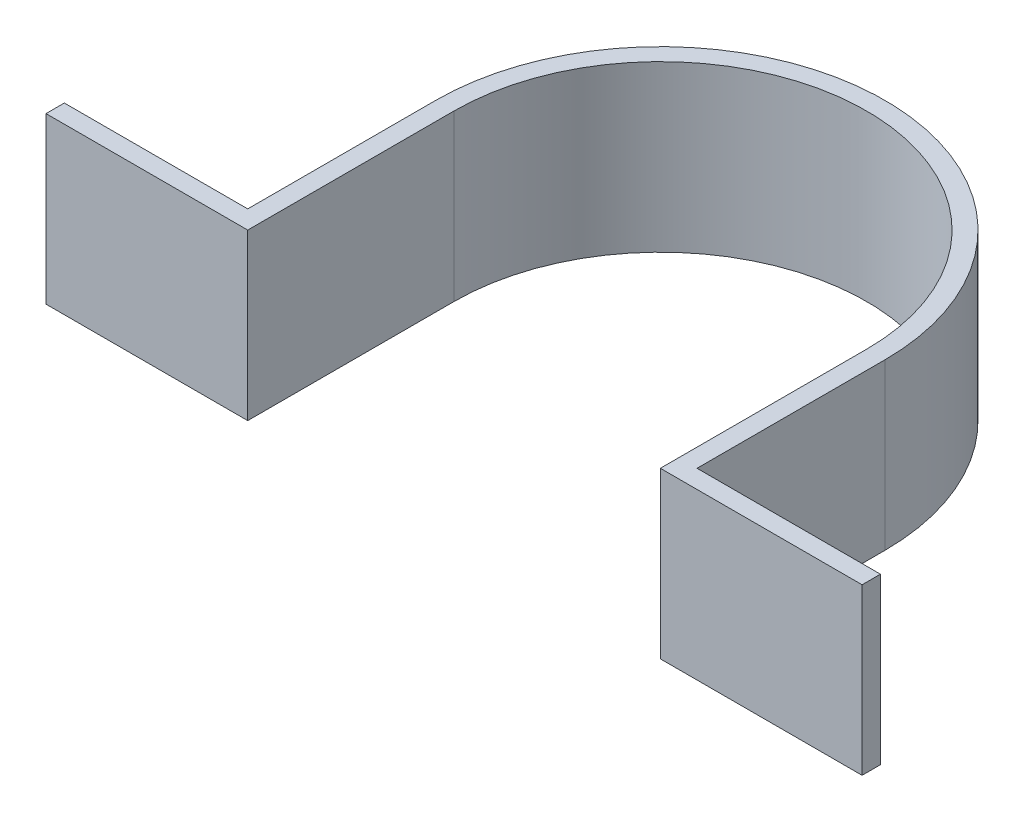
ISO-10303-21;
HEADER;
FILE_DESCRIPTION(('STEP AP214'),'2;1');
FILE_NAME('part.step','',(''),(''),'','','');
FILE_SCHEMA(('AUTOMOTIVE_DESIGN { 1 0 10303 214 1 1 1 1 }'));
ENDSEC;
DATA;
#1=APPLICATION_CONTEXT('core data for automotive mechanical design processes');
#2=APPLICATION_PROTOCOL_DEFINITION('international standard','automotive_design',2000,#1);
#3=PRODUCT_CONTEXT('',#1,'mechanical');
#4=PRODUCT('Part','Part','',(#3));
#5=PRODUCT_RELATED_PRODUCT_CATEGORY('part','',(#4));
#6=PRODUCT_DEFINITION_FORMATION('','',#4);
#7=PRODUCT_DEFINITION_CONTEXT('part definition',#1,'design');
#8=PRODUCT_DEFINITION('design','',#6,#7);
#9=PRODUCT_DEFINITION_SHAPE('','',#8);
#10=(LENGTH_UNIT() NAMED_UNIT(*) SI_UNIT(.MILLI.,.METRE.));
#11=(NAMED_UNIT(*) PLANE_ANGLE_UNIT() SI_UNIT($,.RADIAN.));
#12=(NAMED_UNIT(*) SI_UNIT($,.STERADIAN.) SOLID_ANGLE_UNIT());
#13=UNCERTAINTY_MEASURE_WITH_UNIT(LENGTH_MEASURE(1.E-05),#10,'distance_accuracy_value','');
#14=(GEOMETRIC_REPRESENTATION_CONTEXT(3) GLOBAL_UNCERTAINTY_ASSIGNED_CONTEXT((#13)) GLOBAL_UNIT_ASSIGNED_CONTEXT((#10,
#11,#12)) REPRESENTATION_CONTEXT('',''));
#15=CARTESIAN_POINT('',(0.,0.,0.));
#16=DIRECTION('',(0.,0.,1.));
#17=DIRECTION('',(1.,0.,0.));
#18=AXIS2_PLACEMENT_3D('',#15,#16,#17);
#19=CARTESIAN_POINT('',(0.,18.,0.));
#20=DIRECTION('',(0.,-1.,0.));
#21=DIRECTION('',(0.,0.,-1.));
#22=AXIS2_PLACEMENT_3D('',#19,#20,#21);
#23=CYLINDRICAL_SURFACE('',#22,22.5);
#24=CARTESIAN_POINT('',(0.,0.,0.));
#25=DIRECTION('',(0.,-1.,0.));
#26=DIRECTION('',(0.,0.,1.));
#27=AXIS2_PLACEMENT_3D('',#24,#25,#26);
#28=CIRCLE('',#27,22.5);
#29=CARTESIAN_POINT('',(-22.5,0.,0.));
#30=VERTEX_POINT('',#29);
#31=CARTESIAN_POINT('',(22.5,0.,0.));
#32=VERTEX_POINT('',#31);
#33=EDGE_CURVE('E168',#30,#32,#28,.T.);
#34=ORIENTED_EDGE('',*,*,#33,.T.);
#35=DIRECTION('',(0.,-1.,0.));
#36=VECTOR('',#35,1.);
#37=CARTESIAN_POINT('',(22.5,18.,0.));
#38=LINE('',#37,#36);
#39=CARTESIAN_POINT('',(22.5,18.,0.));
#40=VERTEX_POINT('',#39);
#41=EDGE_CURVE('E11',#40,#32,#38,.T.);
#42=ORIENTED_EDGE('',*,*,#41,.F.);
#43=CARTESIAN_POINT('',(0.,18.,0.));
#44=DIRECTION('',(0.,-1.,0.));
#45=DIRECTION('',(0.,0.,1.));
#46=AXIS2_PLACEMENT_3D('',#43,#44,#45);
#47=CIRCLE('',#46,22.5);
#48=CARTESIAN_POINT('',(-22.5,18.,0.));
#49=VERTEX_POINT('',#48);
#50=EDGE_CURVE('E202',#49,#40,#47,.T.);
#51=ORIENTED_EDGE('',*,*,#50,.F.);
#52=DIRECTION('',(0.,-1.,0.));
#53=VECTOR('',#52,1.);
#54=CARTESIAN_POINT('',(-22.5,18.,0.));
#55=LINE('',#54,#53);
#56=EDGE_CURVE('E164',#49,#30,#55,.T.);
#57=ORIENTED_EDGE('',*,*,#56,.T.);
#58=EDGE_LOOP('',(#34,#42,#51,#57));
#59=FACE_BOUND('',#58,.T.);
#60=ADVANCED_FACE('F43',(#59),#23,.F.);
#61=CARTESIAN_POINT('',(22.5,18.,0.));
#62=DIRECTION('',(1.,0.,0.));
#63=DIRECTION('',(0.,0.,-1.));
#64=AXIS2_PLACEMENT_3D('',#61,#62,#63);
#65=PLANE('',#64);
#66=DIRECTION('',(0.,0.,1.));
#67=VECTOR('',#66,1.);
#68=CARTESIAN_POINT('',(22.5,0.,0.));
#69=LINE('',#68,#67);
#70=CARTESIAN_POINT('',(22.5000000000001,0.,22.5));
#71=VERTEX_POINT('',#70);
#72=EDGE_CURVE('E172',#32,#71,#69,.T.);
#73=ORIENTED_EDGE('',*,*,#72,.T.);
#74=DIRECTION('',(0.,-1.,0.));
#75=VECTOR('',#74,1.);
#76=CARTESIAN_POINT('',(22.5000000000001,18.,22.5));
#77=LINE('',#76,#75);
#78=CARTESIAN_POINT('',(22.5000000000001,18.,22.5));
#79=VERTEX_POINT('',#78);
#80=EDGE_CURVE('E52',#79,#71,#77,.T.);
#81=ORIENTED_EDGE('',*,*,#80,.F.);
#82=DIRECTION('',(0.,0.,1.));
#83=VECTOR('',#82,1.);
#84=CARTESIAN_POINT('',(22.5,18.,0.));
#85=LINE('',#84,#83);
#86=EDGE_CURVE('E115',#40,#79,#85,.T.);
#87=ORIENTED_EDGE('',*,*,#86,.F.);
#88=ORIENTED_EDGE('',*,*,#41,.T.);
#89=EDGE_LOOP('',(#73,#81,#87,#88));
#90=FACE_BOUND('',#89,.T.);
#91=ADVANCED_FACE('F296',(#90),#65,.F.);
#92=CARTESIAN_POINT('',(22.5000000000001,18.,22.5));
#93=DIRECTION('',(0.,0.,-1.));
#94=DIRECTION('',(-1.,0.,0.));
#95=AXIS2_PLACEMENT_3D('',#92,#93,#94);
#96=PLANE('',#95);
#97=DIRECTION('',(1.,0.,0.));
#98=VECTOR('',#97,1.);
#99=CARTESIAN_POINT('',(22.5000000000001,0.,22.5));
#100=LINE('',#99,#98);
#101=CARTESIAN_POINT('',(44.5000000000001,0.,22.5));
#102=VERTEX_POINT('',#101);
#103=EDGE_CURVE('E175',#71,#102,#100,.T.);
#104=ORIENTED_EDGE('',*,*,#103,.T.);
#105=DIRECTION('',(0.,-1.,0.));
#106=VECTOR('',#105,1.);
#107=CARTESIAN_POINT('',(44.5000000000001,18.,22.5));
#108=LINE('',#107,#106);
#109=CARTESIAN_POINT('',(44.5000000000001,18.,22.5));
#110=VERTEX_POINT('',#109);
#111=EDGE_CURVE('E229',#110,#102,#108,.T.);
#112=ORIENTED_EDGE('',*,*,#111,.F.);
#113=DIRECTION('',(1.,0.,0.));
#114=VECTOR('',#113,1.);
#115=CARTESIAN_POINT('',(22.5000000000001,18.,22.5));
#116=LINE('',#115,#114);
#117=EDGE_CURVE('E239',#79,#110,#116,.T.);
#118=ORIENTED_EDGE('',*,*,#117,.F.);
#119=ORIENTED_EDGE('',*,*,#80,.T.);
#120=EDGE_LOOP('',(#104,#112,#118,#119));
#121=FACE_BOUND('',#120,.T.);
#122=ADVANCED_FACE('F237',(#121),#96,.F.);
#123=CARTESIAN_POINT('',(44.5000000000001,18.,22.5));
#124=DIRECTION('',(-1.,0.,0.));
#125=DIRECTION('',(0.,0.,1.));
#126=AXIS2_PLACEMENT_3D('',#123,#124,#125);
#127=PLANE('',#126);
#128=DIRECTION('',(0.,0.,-1.));
#129=VECTOR('',#128,1.);
#130=CARTESIAN_POINT('',(44.5000000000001,0.,22.5));
#131=LINE('',#130,#129);
#132=CARTESIAN_POINT('',(44.5000000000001,0.,20.5));
#133=VERTEX_POINT('',#132);
#134=EDGE_CURVE('E178',#102,#133,#131,.T.);
#135=ORIENTED_EDGE('',*,*,#134,.T.);
#136=DIRECTION('',(0.,-1.,0.));
#137=VECTOR('',#136,1.);
#138=CARTESIAN_POINT('',(44.5000000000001,18.,20.5));
#139=LINE('',#138,#137);
#140=CARTESIAN_POINT('',(44.5000000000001,18.,20.5));
#141=VERTEX_POINT('',#140);
#142=EDGE_CURVE('E225',#141,#133,#139,.T.);
#143=ORIENTED_EDGE('',*,*,#142,.F.);
#144=DIRECTION('',(0.,0.,-1.));
#145=VECTOR('',#144,1.);
#146=CARTESIAN_POINT('',(44.5000000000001,18.,22.5));
#147=LINE('',#146,#145);
#148=EDGE_CURVE('E258',#110,#141,#147,.T.);
#149=ORIENTED_EDGE('',*,*,#148,.F.);
#150=ORIENTED_EDGE('',*,*,#111,.T.);
#151=EDGE_LOOP('',(#135,#143,#149,#150));
#152=FACE_BOUND('',#151,.T.);
#153=ADVANCED_FACE('F248',(#152),#127,.F.);
#154=CARTESIAN_POINT('',(24.5000000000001,18.,20.5));
#155=DIRECTION('',(0.,0.,1.));
#156=DIRECTION('',(1.,0.,0.));
#157=AXIS2_PLACEMENT_3D('',#154,#155,#156);
#158=PLANE('',#157);
#159=DIRECTION('',(-1.,0.,0.));
#160=VECTOR('',#159,1.);
#161=CARTESIAN_POINT('',(24.5000000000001,0.,20.5));
#162=LINE('',#161,#160);
#163=CARTESIAN_POINT('',(24.5000000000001,0.,20.5));
#164=VERTEX_POINT('',#163);
#165=EDGE_CURVE('E181',#133,#164,#162,.T.);
#166=ORIENTED_EDGE('',*,*,#165,.T.);
#167=DIRECTION('',(0.,-1.,0.));
#168=VECTOR('',#167,1.);
#169=CARTESIAN_POINT('',(24.5000000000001,18.,20.5));
#170=LINE('',#169,#168);
#171=CARTESIAN_POINT('',(24.5000000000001,18.,20.5));
#172=VERTEX_POINT('',#171);
#173=EDGE_CURVE('E221',#172,#164,#170,.T.);
#174=ORIENTED_EDGE('',*,*,#173,.F.);
#175=DIRECTION('',(-1.,0.,0.));
#176=VECTOR('',#175,1.);
#177=CARTESIAN_POINT('',(24.5000000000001,18.,20.5));
#178=LINE('',#177,#176);
#179=EDGE_CURVE('E254',#141,#172,#178,.T.);
#180=ORIENTED_EDGE('',*,*,#179,.F.);
#181=ORIENTED_EDGE('',*,*,#142,.T.);
#182=EDGE_LOOP('',(#166,#174,#180,#181));
#183=FACE_BOUND('',#182,.T.);
#184=ADVANCED_FACE('F252',(#183),#158,.F.);
#185=CARTESIAN_POINT('',(24.5,18.,0.));
#186=DIRECTION('',(-1.,0.,0.));
#187=DIRECTION('',(0.,0.,1.));
#188=AXIS2_PLACEMENT_3D('',#185,#186,#187);
#189=PLANE('',#188);
#190=DIRECTION('',(0.,0.,-1.));
#191=VECTOR('',#190,1.);
#192=CARTESIAN_POINT('',(24.5,0.,0.));
#193=LINE('',#192,#191);
#194=CARTESIAN_POINT('',(24.5,0.,0.));
#195=VERTEX_POINT('',#194);
#196=EDGE_CURVE('E184',#164,#195,#193,.T.);
#197=ORIENTED_EDGE('',*,*,#196,.T.);
#198=DIRECTION('',(0.,-1.,0.));
#199=VECTOR('',#198,1.);
#200=CARTESIAN_POINT('',(24.5,18.,0.));
#201=LINE('',#200,#199);
#202=CARTESIAN_POINT('',(24.5,18.,0.));
#203=VERTEX_POINT('',#202);
#204=EDGE_CURVE('E217',#203,#195,#201,.T.);
#205=ORIENTED_EDGE('',*,*,#204,.F.);
#206=DIRECTION('',(0.,0.,-1.));
#207=VECTOR('',#206,1.);
#208=CARTESIAN_POINT('',(24.5,18.,0.));
#209=LINE('',#208,#207);
#210=EDGE_CURVE('E257',#172,#203,#209,.T.);
#211=ORIENTED_EDGE('',*,*,#210,.F.);
#212=ORIENTED_EDGE('',*,*,#173,.T.);
#213=EDGE_LOOP('',(#197,#205,#211,#212));
#214=FACE_BOUND('',#213,.T.);
#215=ADVANCED_FACE('F309',(#214),#189,.F.);
#216=CARTESIAN_POINT('',(0.,18.,0.));
#217=DIRECTION('',(0.,-1.,0.));
#218=DIRECTION('',(0.,0.,-1.));
#219=AXIS2_PLACEMENT_3D('',#216,#217,#218);
#220=CYLINDRICAL_SURFACE('',#219,24.5);
#221=CARTESIAN_POINT('',(0.,0.,0.));
#222=DIRECTION('',(0.,1.,0.));
#223=DIRECTION('',(0.,0.,1.));
#224=AXIS2_PLACEMENT_3D('',#221,#222,#223);
#225=CIRCLE('',#224,24.5);
#226=CARTESIAN_POINT('',(-24.5,0.,0.));
#227=VERTEX_POINT('',#226);
#228=EDGE_CURVE('E187',#195,#227,#225,.T.);
#229=ORIENTED_EDGE('',*,*,#228,.T.);
#230=DIRECTION('',(0.,-1.,0.));
#231=VECTOR('',#230,1.);
#232=CARTESIAN_POINT('',(-24.5,18.,0.));
#233=LINE('',#232,#231);
#234=CARTESIAN_POINT('',(-24.5,18.,0.));
#235=VERTEX_POINT('',#234);
#236=EDGE_CURVE('E213',#235,#227,#233,.T.);
#237=ORIENTED_EDGE('',*,*,#236,.F.);
#238=CARTESIAN_POINT('',(0.,18.,0.));
#239=DIRECTION('',(0.,1.,0.));
#240=DIRECTION('',(0.,0.,1.));
#241=AXIS2_PLACEMENT_3D('',#238,#239,#240);
#242=CIRCLE('',#241,24.5);
#243=EDGE_CURVE('E262',#203,#235,#242,.T.);
#244=ORIENTED_EDGE('',*,*,#243,.F.);
#245=ORIENTED_EDGE('',*,*,#204,.T.);
#246=EDGE_LOOP('',(#229,#237,#244,#245));
#247=FACE_BOUND('',#246,.T.);
#248=ADVANCED_FACE('F312',(#247),#220,.T.);
#249=CARTESIAN_POINT('',(-24.5,18.,0.));
#250=DIRECTION('',(1.,0.,0.));
#251=DIRECTION('',(0.,0.,-1.));
#252=AXIS2_PLACEMENT_3D('',#249,#250,#251);
#253=PLANE('',#252);
#254=DIRECTION('',(0.,0.,1.));
#255=VECTOR('',#254,1.);
#256=CARTESIAN_POINT('',(-24.5,0.,0.));
#257=LINE('',#256,#255);
#258=CARTESIAN_POINT('',(-24.4999999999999,0.,20.5));
#259=VERTEX_POINT('',#258);
#260=EDGE_CURVE('E190',#227,#259,#257,.T.);
#261=ORIENTED_EDGE('',*,*,#260,.T.);
#262=DIRECTION('',(0.,-1.,0.));
#263=VECTOR('',#262,1.);
#264=CARTESIAN_POINT('',(-24.4999999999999,18.,20.5));
#265=LINE('',#264,#263);
#266=CARTESIAN_POINT('',(-24.4999999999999,18.,20.5));
#267=VERTEX_POINT('',#266);
#268=EDGE_CURVE('E209',#267,#259,#265,.T.);
#269=ORIENTED_EDGE('',*,*,#268,.F.);
#270=DIRECTION('',(0.,0.,1.));
#271=VECTOR('',#270,1.);
#272=CARTESIAN_POINT('',(-24.5,18.,0.));
#273=LINE('',#272,#271);
#274=EDGE_CURVE('E269',#235,#267,#273,.T.);
#275=ORIENTED_EDGE('',*,*,#274,.F.);
#276=ORIENTED_EDGE('',*,*,#236,.T.);
#277=EDGE_LOOP('',(#261,#269,#275,#276));
#278=FACE_BOUND('',#277,.T.);
#279=ADVANCED_FACE('F277',(#278),#253,.F.);
#280=CARTESIAN_POINT('',(-24.4999999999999,18.,20.5));
#281=DIRECTION('',(0.,0.,1.));
#282=DIRECTION('',(1.,0.,0.));
#283=AXIS2_PLACEMENT_3D('',#280,#281,#282);
#284=PLANE('',#283);
#285=DIRECTION('',(-1.,0.,0.));
#286=VECTOR('',#285,1.);
#287=CARTESIAN_POINT('',(-24.4999999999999,0.,20.5));
#288=LINE('',#287,#286);
#289=CARTESIAN_POINT('',(-44.4999999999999,0.,20.5));
#290=VERTEX_POINT('',#289);
#291=EDGE_CURVE('E193',#259,#290,#288,.T.);
#292=ORIENTED_EDGE('',*,*,#291,.T.);
#293=DIRECTION('',(0.,-1.,0.));
#294=VECTOR('',#293,1.);
#295=CARTESIAN_POINT('',(-44.4999999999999,18.,20.5));
#296=LINE('',#295,#294);
#297=CARTESIAN_POINT('',(-44.4999999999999,18.,20.5));
#298=VERTEX_POINT('',#297);
#299=EDGE_CURVE('E157',#298,#290,#296,.T.);
#300=ORIENTED_EDGE('',*,*,#299,.F.);
#301=DIRECTION('',(-1.,0.,0.));
#302=VECTOR('',#301,1.);
#303=CARTESIAN_POINT('',(-24.4999999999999,18.,20.5));
#304=LINE('',#303,#302);
#305=EDGE_CURVE('E146',#267,#298,#304,.T.);
#306=ORIENTED_EDGE('',*,*,#305,.F.);
#307=ORIENTED_EDGE('',*,*,#268,.T.);
#308=EDGE_LOOP('',(#292,#300,#306,#307));
#309=FACE_BOUND('',#308,.T.);
#310=ADVANCED_FACE('F281',(#309),#284,.F.);
#311=CARTESIAN_POINT('',(-44.4999999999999,18.,22.5));
#312=DIRECTION('',(1.,0.,0.));
#313=DIRECTION('',(0.,0.,-1.));
#314=AXIS2_PLACEMENT_3D('',#311,#312,#313);
#315=PLANE('',#314);
#316=DIRECTION('',(0.,0.,1.));
#317=VECTOR('',#316,1.);
#318=CARTESIAN_POINT('',(-44.4999999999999,0.,22.5));
#319=LINE('',#318,#317);
#320=CARTESIAN_POINT('',(-44.4999999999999,0.,22.5));
#321=VERTEX_POINT('',#320);
#322=EDGE_CURVE('E155',#290,#321,#319,.T.);
#323=ORIENTED_EDGE('',*,*,#322,.T.);
#324=DIRECTION('',(0.,-1.,0.));
#325=VECTOR('',#324,1.);
#326=CARTESIAN_POINT('',(-44.4999999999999,18.,22.5));
#327=LINE('',#326,#325);
#328=CARTESIAN_POINT('',(-44.4999999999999,18.,22.5));
#329=VERTEX_POINT('',#328);
#330=EDGE_CURVE('E152',#329,#321,#327,.T.);
#331=ORIENTED_EDGE('',*,*,#330,.F.);
#332=DIRECTION('',(0.,0.,1.));
#333=VECTOR('',#332,1.);
#334=CARTESIAN_POINT('',(-44.4999999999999,18.,22.5));
#335=LINE('',#334,#333);
#336=EDGE_CURVE('E140',#298,#329,#335,.T.);
#337=ORIENTED_EDGE('',*,*,#336,.F.);
#338=ORIENTED_EDGE('',*,*,#299,.T.);
#339=EDGE_LOOP('',(#323,#331,#337,#338));
#340=FACE_BOUND('',#339,.T.);
#341=ADVANCED_FACE('F153',(#340),#315,.F.);
#342=CARTESIAN_POINT('',(-22.4999999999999,18.,22.5));
#343=DIRECTION('',(0.,0.,-1.));
#344=DIRECTION('',(-1.,0.,0.));
#345=AXIS2_PLACEMENT_3D('',#342,#343,#344);
#346=PLANE('',#345);
#347=DIRECTION('',(1.,0.,0.));
#348=VECTOR('',#347,1.);
#349=CARTESIAN_POINT('',(-22.4999999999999,0.,22.5));
#350=LINE('',#349,#348);
#351=CARTESIAN_POINT('',(-22.4999999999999,0.,22.5));
#352=VERTEX_POINT('',#351);
#353=EDGE_CURVE('E101',#321,#352,#350,.T.);
#354=ORIENTED_EDGE('',*,*,#353,.T.);
#355=DIRECTION('',(0.,-1.,0.));
#356=VECTOR('',#355,1.);
#357=CARTESIAN_POINT('',(-22.4999999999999,18.,22.5));
#358=LINE('',#357,#356);
#359=CARTESIAN_POINT('',(-22.4999999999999,18.,22.5));
#360=VERTEX_POINT('',#359);
#361=EDGE_CURVE('E158',#360,#352,#358,.T.);
#362=ORIENTED_EDGE('',*,*,#361,.F.);
#363=DIRECTION('',(1.,0.,0.));
#364=VECTOR('',#363,1.);
#365=CARTESIAN_POINT('',(-22.4999999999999,18.,22.5));
#366=LINE('',#365,#364);
#367=EDGE_CURVE('E144',#329,#360,#366,.T.);
#368=ORIENTED_EDGE('',*,*,#367,.F.);
#369=ORIENTED_EDGE('',*,*,#330,.T.);
#370=EDGE_LOOP('',(#354,#362,#368,#369));
#371=FACE_BOUND('',#370,.T.);
#372=ADVANCED_FACE('F160',(#371),#346,.F.);
#373=CARTESIAN_POINT('',(-22.5,18.,0.));
#374=DIRECTION('',(-1.,0.,0.));
#375=DIRECTION('',(0.,0.,1.));
#376=AXIS2_PLACEMENT_3D('',#373,#374,#375);
#377=PLANE('',#376);
#378=DIRECTION('',(0.,0.,-1.));
#379=VECTOR('',#378,1.);
#380=CARTESIAN_POINT('',(-22.5,0.,0.));
#381=LINE('',#380,#379);
#382=EDGE_CURVE('E107',#352,#30,#381,.T.);
#383=ORIENTED_EDGE('',*,*,#382,.T.);
#384=ORIENTED_EDGE('',*,*,#56,.F.);
#385=DIRECTION('',(0.,0.,-1.));
#386=VECTOR('',#385,1.);
#387=CARTESIAN_POINT('',(-22.5,18.,0.));
#388=LINE('',#387,#386);
#389=EDGE_CURVE('E60',#360,#49,#388,.T.);
#390=ORIENTED_EDGE('',*,*,#389,.F.);
#391=ORIENTED_EDGE('',*,*,#361,.T.);
#392=EDGE_LOOP('',(#383,#384,#390,#391));
#393=FACE_BOUND('',#392,.T.);
#394=ADVANCED_FACE('F285',(#393),#377,.F.);
#395=CARTESIAN_POINT('',(0.,18.,0.));
#396=DIRECTION('',(0.,1.,0.));
#397=DIRECTION('',(0.,0.,1.));
#398=AXIS2_PLACEMENT_3D('',#395,#396,#397);
#399=PLANE('',#398);
#400=ORIENTED_EDGE('',*,*,#50,.T.);
#401=ORIENTED_EDGE('',*,*,#86,.T.);
#402=ORIENTED_EDGE('',*,*,#117,.T.);
#403=ORIENTED_EDGE('',*,*,#148,.T.);
#404=ORIENTED_EDGE('',*,*,#179,.T.);
#405=ORIENTED_EDGE('',*,*,#210,.T.);
#406=ORIENTED_EDGE('',*,*,#243,.T.);
#407=ORIENTED_EDGE('',*,*,#274,.T.);
#408=ORIENTED_EDGE('',*,*,#305,.T.);
#409=ORIENTED_EDGE('',*,*,#336,.T.);
#410=ORIENTED_EDGE('',*,*,#367,.T.);
#411=ORIENTED_EDGE('',*,*,#389,.T.);
#412=EDGE_LOOP('',(#400,#401,#402,#403,#404,#405,#406,#407,#408,#409,#410,#411));
#413=FACE_BOUND('',#412,.T.);
#414=ADVANCED_FACE('F142',(#413),#399,.T.);
#415=CARTESIAN_POINT('',(0.,0.,0.));
#416=DIRECTION('',(0.,1.,0.));
#417=DIRECTION('',(0.,0.,1.));
#418=AXIS2_PLACEMENT_3D('',#415,#416,#417);
#419=PLANE('',#418);
#420=ORIENTED_EDGE('',*,*,#33,.F.);
#421=ORIENTED_EDGE('',*,*,#382,.F.);
#422=ORIENTED_EDGE('',*,*,#353,.F.);
#423=ORIENTED_EDGE('',*,*,#322,.F.);
#424=ORIENTED_EDGE('',*,*,#291,.F.);
#425=ORIENTED_EDGE('',*,*,#260,.F.);
#426=ORIENTED_EDGE('',*,*,#228,.F.);
#427=ORIENTED_EDGE('',*,*,#196,.F.);
#428=ORIENTED_EDGE('',*,*,#165,.F.);
#429=ORIENTED_EDGE('',*,*,#134,.F.);
#430=ORIENTED_EDGE('',*,*,#103,.F.);
#431=ORIENTED_EDGE('',*,*,#72,.F.);
#432=EDGE_LOOP('',(#420,#421,#422,#423,#424,#425,#426,#427,#428,#429,#430,#431));
#433=FACE_BOUND('',#432,.T.);
#434=ADVANCED_FACE('F243',(#433),#419,.F.);
#435=CLOSED_SHELL('',(#60,#91,#122,#153,#184,#215,#248,#279,#310,#341,#372,#394,#414,#434));
#436=MANIFOLD_SOLID_BREP('B2',#435);
#437=ADVANCED_BREP_SHAPE_REPRESENTATION('',(#18,#436),#14);
#438=SHAPE_DEFINITION_REPRESENTATION(#9,#437);
ENDSEC;
END-ISO-10303-21;
